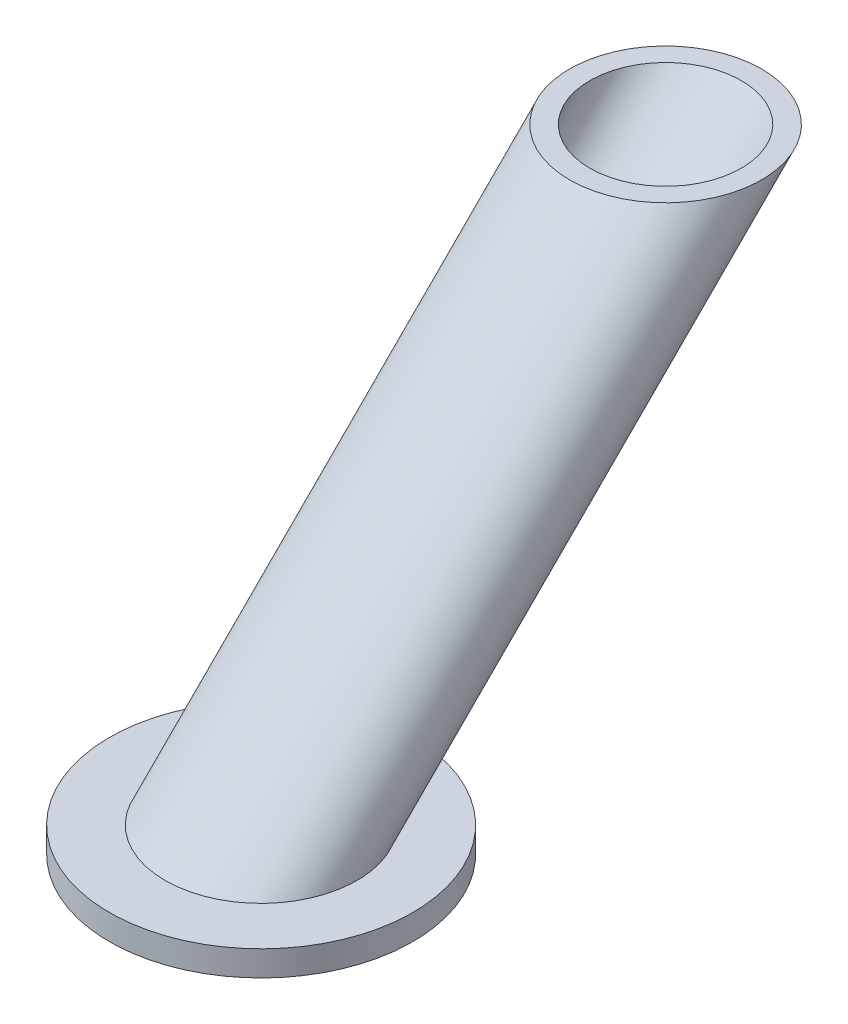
from build123d import *

# Parameters (mm, degrees)
SKETCH1_R      = 24.13
SKETCH1_R_2    = 19.05
SKETCH3_R      = 38.1
SKETCH3_R_2    = 19.05
EXTRUDE1_DEPTH = 6.35


with BuildPart() as part:
    # Sweep1: sweep along a path in Sketch2
    with BuildLine(Plane(origin=(0, 0, 0), x_dir=(0, 0, -1), z_dir=(1, 0, 0))) as sweep1_path:
        Line((0, 0), (-101.6, -101.6))
    # Sketch1 → Sweep1 (sweep)
    with BuildSketch(Plane(origin=(0, 0, 0), x_dir=(1, 0, 0), z_dir=(0, 1, 0))):
        Circle(SKETCH1_R)
        Circle(SKETCH1_R_2, mode=Mode.SUBTRACT)
    sweep(path=sweep1_path.line)

    # Sketch3 → Extrude1 (add)
    with BuildSketch(Plane.XZ.offset(101.6)):
        with Locations(Location((0, 101.6, 0), (0, 0, 270))):
            Circle(SKETCH3_R)
        with Locations(Location((0, 101.6, 0), (0, 0, 90))):
            Circle(SKETCH3_R_2, mode=Mode.SUBTRACT)
    extrude(amount=EXTRUDE1_DEPTH)


solid = part.part
